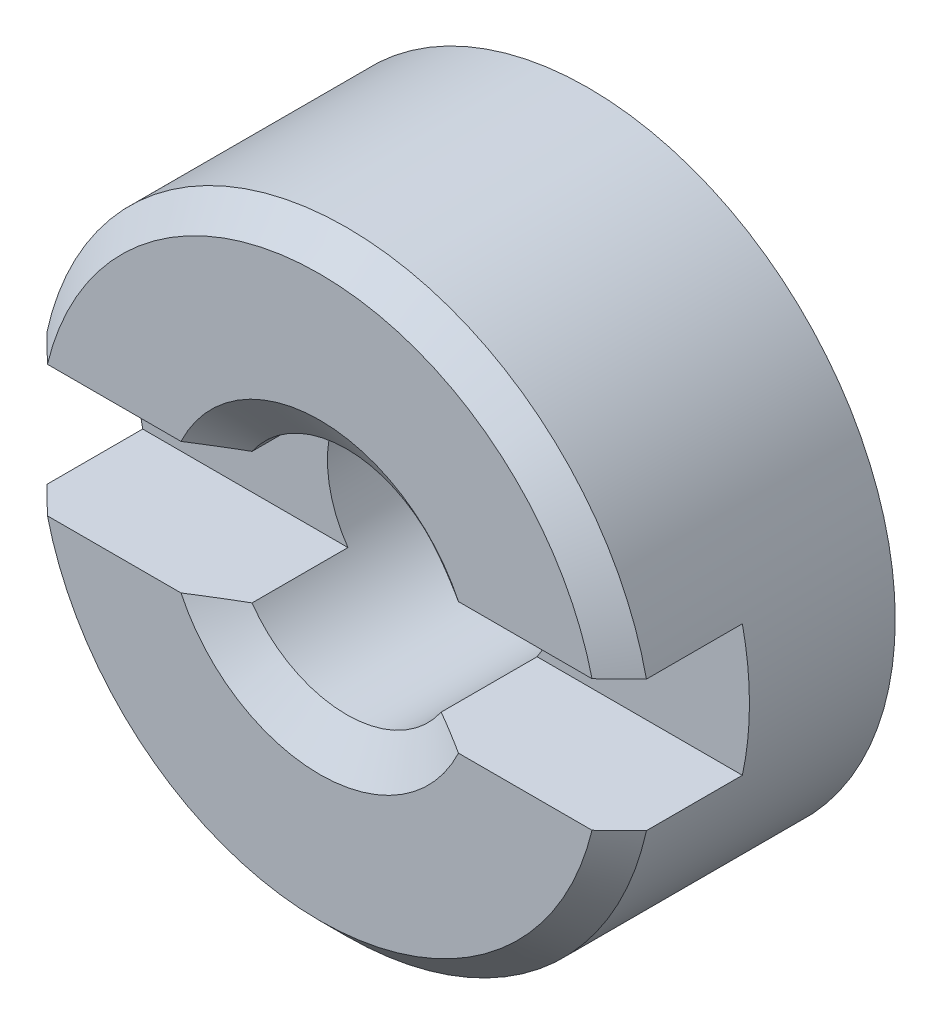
ISO-10303-21;
HEADER;
FILE_DESCRIPTION(('STEP AP214'),'2;1');
FILE_NAME('part.step','',(''),(''),'','','');
FILE_SCHEMA(('AUTOMOTIVE_DESIGN { 1 0 10303 214 1 1 1 1 }'));
ENDSEC;
DATA;
#1=APPLICATION_CONTEXT('core data for automotive mechanical design processes');
#2=APPLICATION_PROTOCOL_DEFINITION('international standard','automotive_design',2000,#1);
#3=PRODUCT_CONTEXT('',#1,'mechanical');
#4=PRODUCT('Part','Part','',(#3));
#5=PRODUCT_RELATED_PRODUCT_CATEGORY('part','',(#4));
#6=PRODUCT_DEFINITION_FORMATION('','',#4);
#7=PRODUCT_DEFINITION_CONTEXT('part definition',#1,'design');
#8=PRODUCT_DEFINITION('design','',#6,#7);
#9=PRODUCT_DEFINITION_SHAPE('','',#8);
#10=(LENGTH_UNIT() NAMED_UNIT(*) SI_UNIT(.MILLI.,.METRE.));
#11=(NAMED_UNIT(*) PLANE_ANGLE_UNIT() SI_UNIT($,.RADIAN.));
#12=(NAMED_UNIT(*) SI_UNIT($,.STERADIAN.) SOLID_ANGLE_UNIT());
#13=UNCERTAINTY_MEASURE_WITH_UNIT(LENGTH_MEASURE(1.E-05),#10,'distance_accuracy_value','');
#14=(GEOMETRIC_REPRESENTATION_CONTEXT(3) GLOBAL_UNCERTAINTY_ASSIGNED_CONTEXT((#13)) GLOBAL_UNIT_ASSIGNED_CONTEXT((#10,
#11,#12)) REPRESENTATION_CONTEXT('',''));
#15=CARTESIAN_POINT('',(0.,0.,0.));
#16=DIRECTION('',(0.,0.,1.));
#17=DIRECTION('',(1.,0.,0.));
#18=AXIS2_PLACEMENT_3D('',#15,#16,#17);
#19=CARTESIAN_POINT('',(0.,0.,0.));
#20=DIRECTION('',(0.,0.,1.));
#21=DIRECTION('',(1.,0.,0.));
#22=AXIS2_PLACEMENT_3D('',#19,#20,#21);
#23=PLANE('',#22);
#24=DIRECTION('',(1.,0.,0.));
#25=VECTOR('',#24,1.);
#26=CARTESIAN_POINT('',(-4.,-0.855000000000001,0.));
#27=LINE('',#26,#25);
#28=CARTESIAN_POINT('',(-3.54844684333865,-0.855000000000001,0.));
#29=VERTEX_POINT('',#28);
#30=CARTESIAN_POINT('',(-1.80803069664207,-0.855000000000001,0.));
#31=VERTEX_POINT('',#30);
#32=EDGE_CURVE('E298',#29,#31,#27,.T.);
#33=ORIENTED_EDGE('',*,*,#32,.F.);
#34=CARTESIAN_POINT('',(0.,0.,0.));
#35=DIRECTION('',(0.,0.,1.));
#36=DIRECTION('',(1.,0.,0.));
#37=AXIS2_PLACEMENT_3D('',#34,#35,#36);
#38=CIRCLE('',#37,3.65);
#39=CARTESIAN_POINT('',(3.54844684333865,-0.855000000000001,0.));
#40=VERTEX_POINT('',#39);
#41=EDGE_CURVE('E160',#29,#40,#38,.T.);
#42=ORIENTED_EDGE('',*,*,#41,.T.);
#43=CARTESIAN_POINT('',(1.80803069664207,-0.855000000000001,0.));
#44=VERTEX_POINT('',#43);
#45=EDGE_CURVE('E142',#44,#40,#27,.T.);
#46=ORIENTED_EDGE('',*,*,#45,.F.);
#47=CARTESIAN_POINT('',(0.,0.,0.));
#48=DIRECTION('',(0.,0.,1.));
#49=DIRECTION('',(1.,0.,0.));
#50=AXIS2_PLACEMENT_3D('',#47,#48,#49);
#51=CIRCLE('',#50,2.);
#52=EDGE_CURVE('E148',#31,#44,#51,.T.);
#53=ORIENTED_EDGE('',*,*,#52,.F.);
#54=EDGE_LOOP('',(#33,#42,#46,#53));
#55=FACE_BOUND('',#54,.T.);
#56=ADVANCED_FACE('F35',(#55),#23,.T.);
#57=CARTESIAN_POINT('',(0.,0.,-0.385114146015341));
#58=DIRECTION('',(0.,0.,1.));
#59=DIRECTION('',(1.,0.,0.));
#60=AXIS2_PLACEMENT_3D('',#57,#58,#59);
#61=CONICAL_SURFACE('',#60,1.45,0.959931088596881);
#62=CARTESIAN_POINT('',(-4.40937540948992,-0.855000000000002,1.74457053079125));
#63=CARTESIAN_POINT('',(-4.25360723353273,-0.855000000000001,1.63751142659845));
#64=CARTESIAN_POINT('',(-4.09775711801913,-0.855000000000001,1.53057062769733));
#65=CARTESIAN_POINT('',(-3.78577037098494,-0.855000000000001,1.31706999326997));
#66=CARTESIAN_POINT('',(-3.62963370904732,-0.855000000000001,1.21051020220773));
#67=CARTESIAN_POINT('',(-3.32079444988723,-0.855000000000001,1.00052931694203));
#68=CARTESIAN_POINT('',(-3.16810085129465,-0.855000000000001,0.897094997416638));
#69=CARTESIAN_POINT('',(-2.86219919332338,-0.855000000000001,0.691020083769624));
#70=CARTESIAN_POINT('',(-2.70899118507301,-0.855000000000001,0.58837941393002));
#71=CARTESIAN_POINT('',(-2.46315012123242,-0.855000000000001,0.425138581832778));
#72=CARTESIAN_POINT('',(-2.37078524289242,-0.855000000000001,0.364134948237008));
#73=CARTESIAN_POINT('',(-2.18564135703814,-0.855000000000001,0.242760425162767));
#74=CARTESIAN_POINT('',(-2.0928623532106,-0.855000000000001,0.182389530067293));
#75=CARTESIAN_POINT('',(-1.90509299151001,-0.855000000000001,0.061495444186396));
#76=CARTESIAN_POINT('',(-1.81009237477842,-0.855000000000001,0.000988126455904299));
#77=CARTESIAN_POINT('',(-1.61921586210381,-0.855000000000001,-0.1186201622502));
#78=CARTESIAN_POINT('',(-1.52334001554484,-0.855000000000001,-0.177721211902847));
#79=CARTESIAN_POINT('',(-1.32863387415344,-0.855000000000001,-0.294684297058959));
#80=CARTESIAN_POINT('',(-1.22978097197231,-0.855000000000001,-0.35250924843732));
#81=CARTESIAN_POINT('',(-1.0796375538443,-0.855000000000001,-0.436327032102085));
#82=CARTESIAN_POINT('',(-1.02919029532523,-0.855000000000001,-0.463824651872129));
#83=CARTESIAN_POINT('',(-0.927557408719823,-0.855000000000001,-0.517413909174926));
#84=CARTESIAN_POINT('',(-0.876371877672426,-0.855000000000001,-0.543505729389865));
#85=CARTESIAN_POINT('',(-0.774429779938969,-0.855000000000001,-0.59306129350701));
#86=CARTESIAN_POINT('',(-0.72369861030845,-0.855000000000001,-0.61657679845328));
#87=CARTESIAN_POINT('',(-0.621060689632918,-0.855000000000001,-0.661003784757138));
#88=CARTESIAN_POINT('',(-0.569153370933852,-0.855,-0.681913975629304));
#89=CARTESIAN_POINT('',(-0.464282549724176,-0.855,-0.719886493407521));
#90=CARTESIAN_POINT('',(-0.411327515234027,-0.855,-0.736971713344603));
#91=CARTESIAN_POINT('',(-0.304042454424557,-0.855,-0.765949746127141));
#92=CARTESIAN_POINT('',(-0.24971472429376,-0.855,-0.777850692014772));
#93=CARTESIAN_POINT('',(-0.155937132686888,-0.855,-0.792443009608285));
#94=CARTESIAN_POINT('',(-0.116749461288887,-0.855,-0.796805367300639));
#95=CARTESIAN_POINT('',(-0.0381121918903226,-0.855,-0.801769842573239));
#96=CARTESIAN_POINT('',(0.00133750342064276,-0.855,-0.802370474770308));
#97=CARTESIAN_POINT('',(0.0802103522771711,-0.855,-0.799744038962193));
#98=CARTESIAN_POINT('',(0.119633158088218,-0.855,-0.796506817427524));
#99=CARTESIAN_POINT('',(0.198016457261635,-0.855,-0.786485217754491));
#100=CARTESIAN_POINT('',(0.236976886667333,-0.855,-0.779700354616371));
#101=CARTESIAN_POINT('',(0.349917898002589,-0.855,-0.755440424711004));
#102=CARTESIAN_POINT('',(0.42301252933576,-0.855,-0.733879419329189));
#103=CARTESIAN_POINT('',(0.566671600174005,-0.855,-0.683518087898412));
#104=CARTESIAN_POINT('',(0.637230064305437,-0.855000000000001,-0.654701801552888));
#105=CARTESIAN_POINT('',(0.777924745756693,-0.855000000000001,-0.591925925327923));
#106=CARTESIAN_POINT('',(0.848014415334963,-0.855000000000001,-0.557863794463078));
#107=CARTESIAN_POINT('',(0.951970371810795,-0.855000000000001,-0.504607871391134));
#108=CARTESIAN_POINT('',(0.986408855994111,-0.855000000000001,-0.486505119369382));
#109=CARTESIAN_POINT('',(1.05496676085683,-0.855000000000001,-0.449705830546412));
#110=CARTESIAN_POINT('',(1.08908619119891,-0.855000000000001,-0.431009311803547));
#111=CARTESIAN_POINT('',(1.19991214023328,-0.855000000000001,-0.369269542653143));
#112=CARTESIAN_POINT('',(1.27607417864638,-0.855000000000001,-0.325251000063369));
#113=CARTESIAN_POINT('',(1.4274755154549,-0.855000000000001,-0.235650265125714));
#114=CARTESIAN_POINT('',(1.50271470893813,-0.855000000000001,-0.190067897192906));
#115=CARTESIAN_POINT('',(1.65255851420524,-0.855000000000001,-0.0978219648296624));
#116=CARTESIAN_POINT('',(1.72716291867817,-0.855000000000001,-0.0511580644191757));
#117=CARTESIAN_POINT('',(1.87589265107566,-0.855000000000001,0.0429281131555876));
#118=CARTESIAN_POINT('',(1.95001796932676,-0.855000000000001,0.0903504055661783));
#119=CARTESIAN_POINT('',(2.17208557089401,-0.855000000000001,0.233578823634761));
#120=CARTESIAN_POINT('',(2.31949672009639,-0.855000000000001,0.330207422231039));
#121=CARTESIAN_POINT('',(2.61345746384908,-0.855000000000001,0.524698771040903));
#122=CARTESIAN_POINT('',(2.76000721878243,-0.855000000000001,0.622561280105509));
#123=CARTESIAN_POINT('',(3.03223995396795,-0.855000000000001,0.805432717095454));
#124=CARTESIAN_POINT('',(3.15799261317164,-0.855000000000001,0.890337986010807));
#125=CARTESIAN_POINT('',(3.40922033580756,-0.855000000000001,1.06057383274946));
#126=CARTESIAN_POINT('',(3.53469538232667,-0.855000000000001,1.14590443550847));
#127=CARTESIAN_POINT('',(3.78513117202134,-0.855000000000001,1.31666361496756));
#128=CARTESIAN_POINT('',(3.9100924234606,-0.855000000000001,1.40209144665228));
#129=CARTESIAN_POINT('',(4.15984639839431,-0.855000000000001,1.57317575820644));
#130=CARTESIAN_POINT('',(4.28463913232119,-0.855000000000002,1.65883222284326));
#131=CARTESIAN_POINT('',(4.40937540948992,-0.855000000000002,1.74457053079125));
#132=B_SPLINE_CURVE_WITH_KNOTS('',3,(#62,#63,#64,#65,#66,#67,#68,#69,#70,#71,#72,#73,#74,#75,
#76,#77,#78,#79,#80,#81,#82,#83,#84,#85,#86,#87,#88,#89,#90,#91,#92,#93,#94,#95,#96,#97,#98,#99,
#100,#101,#102,#103,#104,#105,#106,#107,#108,#109,#110,#111,#112,#113,#114,#115,#116,#117,#118,
#119,#120,#121,#122,#123,#124,#125,#126,#127,#128,#129,#130,#131),.UNSPECIFIED.,.F.,.F.,(4,2,2,
2,2,2,2,2,2,2,2,2,2,2,2,2,2,2,2,2,2,2,2,2,2,2,2,2,2,2,2,2,2,2,4),(0.,0.567035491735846,
1.13413512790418,1.68742029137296,2.24065200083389,2.57272607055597,2.90479718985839,
3.24268795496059,3.58055977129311,3.92406456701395,4.09641350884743,4.26873999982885,
4.43643848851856,4.60421971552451,4.77096817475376,4.93745409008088,5.05558103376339,
5.17375461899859,5.29224154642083,5.41074467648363,5.63868407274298,5.86712934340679,
6.10079829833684,6.2175150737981,6.33422830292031,6.5980975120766,6.86199644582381,
7.12597848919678,7.38996584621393,7.91872833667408,8.44738904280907,8.90258413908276,
9.35780624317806,9.81191943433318,10.2660030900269),.UNSPECIFIED.);
#133=CARTESIAN_POINT('',(-1.23246703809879,-0.855000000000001,-0.350103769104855));
#134=VERTEX_POINT('',#133);
#135=EDGE_CURVE('E225',#31,#134,#132,.T.);
#136=ORIENTED_EDGE('',*,*,#135,.F.);
#137=ORIENTED_EDGE('',*,*,#52,.T.);
#138=CARTESIAN_POINT('',(1.23246703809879,-0.855000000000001,-0.350103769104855));
#139=VERTEX_POINT('',#138);
#140=EDGE_CURVE('E216',#139,#44,#132,.T.);
#141=ORIENTED_EDGE('',*,*,#140,.F.);
#142=CARTESIAN_POINT('',(0.,0.,-0.350103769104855));
#143=DIRECTION('',(0.,0.,1.));
#144=DIRECTION('',(1.,0.,0.));
#145=AXIS2_PLACEMENT_3D('',#142,#143,#144);
#146=CIRCLE('',#145,1.5);
#147=EDGE_CURVE('E150',#139,#134,#146,.F.);
#148=ORIENTED_EDGE('',*,*,#147,.T.);
#149=EDGE_LOOP('',(#136,#137,#141,#148));
#150=FACE_BOUND('',#149,.T.);
#151=ADVANCED_FACE('F210',(#150),#61,.F.);
#152=CARTESIAN_POINT('',(0.,0.,0.));
#153=DIRECTION('',(0.,0.,-1.));
#154=DIRECTION('',(-1.,0.,0.));
#155=AXIS2_PLACEMENT_3D('',#152,#153,#154);
#156=CONICAL_SURFACE('',#155,3.65,0.785398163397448);
#157=CARTESIAN_POINT('',(-8.76318031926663,-0.854999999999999,-5.15479155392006));
#158=CARTESIAN_POINT('',(-8.49402061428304,-0.854999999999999,-4.88691027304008));
#159=CARTESIAN_POINT('',(-8.22480880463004,-0.854999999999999,-4.61908130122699));
#160=CARTESIAN_POINT('',(-7.68620112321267,-0.854999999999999,-4.08355401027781));
#161=CARTESIAN_POINT('',(-7.41680523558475,-0.854999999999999,-3.81585570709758));
#162=CARTESIAN_POINT('',(-6.8770905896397,-0.854999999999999,-3.27996166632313));
#163=CARTESIAN_POINT('',(-6.60677127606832,-0.855,-3.01176648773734));
#164=CARTESIAN_POINT('',(-6.06585504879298,-0.855,-2.47571011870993));
#165=CARTESIAN_POINT('',(-5.79525816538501,-0.855,-2.20784889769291));
#166=CARTESIAN_POINT('',(-5.18301951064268,-0.855,-1.6028005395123));
#167=CARTESIAN_POINT('',(-4.84124731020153,-0.855,-1.26574518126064));
#168=CARTESIAN_POINT('',(-4.32755683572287,-0.855,-0.761097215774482));
#169=CARTESIAN_POINT('',(-4.15612571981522,-0.855000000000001,-0.593008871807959));
#170=CARTESIAN_POINT('',(-3.81279848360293,-0.855000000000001,-0.257319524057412));
#171=CARTESIAN_POINT('',(-3.64090238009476,-0.855000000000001,-0.0897185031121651));
#172=CARTESIAN_POINT('',(-3.29679451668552,-0.855000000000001,0.244388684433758));
#173=CARTESIAN_POINT('',(-3.12458432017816,-0.855000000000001,0.41089646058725));
#174=CARTESIAN_POINT('',(-2.77905025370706,-0.855000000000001,0.742803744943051));
#175=CARTESIAN_POINT('',(-2.60572623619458,-0.855000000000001,0.908203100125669));
#176=CARTESIAN_POINT('',(-2.34437209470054,-0.855000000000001,1.15474649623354));
#177=CARTESIAN_POINT('',(-2.25705293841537,-0.855000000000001,1.23664354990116));
#178=CARTESIAN_POINT('',(-2.08175909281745,-0.855000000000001,1.39973233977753));
#179=CARTESIAN_POINT('',(-1.99378441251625,-0.855000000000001,1.48092408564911));
#180=CARTESIAN_POINT('',(-1.81692974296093,-0.855000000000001,1.64227781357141));
#181=CARTESIAN_POINT('',(-1.72804995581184,-0.855000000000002,1.72244001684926));
#182=CARTESIAN_POINT('',(-1.54894207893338,-0.855000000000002,1.88124062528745));
#183=CARTESIAN_POINT('',(-1.4587141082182,-0.855000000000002,1.95987916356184));
#184=CARTESIAN_POINT('',(-1.3307530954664,-0.855000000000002,2.06836833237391));
#185=CARTESIAN_POINT('',(-1.29390585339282,-0.855000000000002,2.09926296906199));
#186=CARTESIAN_POINT('',(-1.21978899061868,-0.855000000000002,2.16054595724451));
#187=CARTESIAN_POINT('',(-1.18251935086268,-0.855000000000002,2.19093428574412));
#188=CARTESIAN_POINT('',(-1.10739658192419,-0.855000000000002,2.25112677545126));
#189=CARTESIAN_POINT('',(-1.06954250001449,-0.855000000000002,2.28092975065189));
#190=CARTESIAN_POINT('',(-0.993196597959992,-0.855000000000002,2.33970603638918));
#191=CARTESIAN_POINT('',(-0.954704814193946,-0.855000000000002,2.36867939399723));
#192=CARTESIAN_POINT('',(-0.8774934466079,-0.855000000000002,2.42511823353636));
#193=CARTESIAN_POINT('',(-0.83878555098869,-0.855000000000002,2.45259963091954));
#194=CARTESIAN_POINT('',(-0.760400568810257,-0.855000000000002,2.50614082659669));
#195=CARTESIAN_POINT('',(-0.720723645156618,-0.855000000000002,2.53220086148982));
#196=CARTESIAN_POINT('',(-0.640252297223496,-0.855000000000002,2.58231166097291));
#197=CARTESIAN_POINT('',(-0.59946100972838,-0.855000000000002,2.60636742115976));
#198=CARTESIAN_POINT('',(-0.516402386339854,-0.855000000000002,2.65175816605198));
#199=CARTESIAN_POINT('',(-0.474136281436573,-0.855000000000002,2.67309535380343));
#200=CARTESIAN_POINT('',(-0.403789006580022,-0.855000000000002,2.70475797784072));
#201=CARTESIAN_POINT('',(-0.376231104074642,-0.855000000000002,2.71624075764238));
#202=CARTESIAN_POINT('',(-0.32038714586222,-0.855000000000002,2.73730940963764));
#203=CARTESIAN_POINT('',(-0.292101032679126,-0.855000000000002,2.74689513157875));
#204=CARTESIAN_POINT('',(-0.235017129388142,-0.855000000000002,2.76370454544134));
#205=CARTESIAN_POINT('',(-0.20622363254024,-0.855000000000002,2.77094260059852));
#206=CARTESIAN_POINT('',(-0.148094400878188,-0.855000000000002,2.78273518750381));
#207=CARTESIAN_POINT('',(-0.118758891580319,-0.855000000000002,2.78729081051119));
#208=CARTESIAN_POINT('',(-0.0593417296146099,-0.855000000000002,2.79345944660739));
#209=CARTESIAN_POINT('',(-0.0292554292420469,-0.855000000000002,2.79502872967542));
#210=CARTESIAN_POINT('',(0.0309120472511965,-0.855000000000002,2.79497046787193));
#211=CARTESIAN_POINT('',(0.0609932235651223,-0.855000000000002,2.7933431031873));
#212=CARTESIAN_POINT('',(0.120937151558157,-0.855000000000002,2.78700616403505));
#213=CARTESIAN_POINT('',(0.150798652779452,-0.855000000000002,2.78228499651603));
#214=CARTESIAN_POINT('',(0.209955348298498,-0.855000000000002,2.77007561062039));
#215=CARTESIAN_POINT('',(0.239250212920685,-0.855000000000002,2.76258582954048));
#216=CARTESIAN_POINT('',(0.308220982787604,-0.855000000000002,2.7419442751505));
#217=CARTESIAN_POINT('',(0.347574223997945,-0.855000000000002,2.72772263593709));
#218=CARTESIAN_POINT('',(0.424880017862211,-0.855000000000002,2.69590172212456));
#219=CARTESIAN_POINT('',(0.462831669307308,-0.855000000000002,2.67830031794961));
#220=CARTESIAN_POINT('',(0.537636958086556,-0.855000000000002,2.64052895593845));
#221=CARTESIAN_POINT('',(0.574484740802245,-0.855000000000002,2.62034755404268));
#222=CARTESIAN_POINT('',(0.647081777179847,-0.855000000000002,2.57814709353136));
#223=CARTESIAN_POINT('',(0.682831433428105,-0.855000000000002,2.55612871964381));
#224=CARTESIAN_POINT('',(0.759786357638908,-0.855000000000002,2.50663594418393));
#225=CARTESIAN_POINT('',(0.800817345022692,-0.855000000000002,2.47889218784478));
#226=CARTESIAN_POINT('',(0.881906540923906,-0.855000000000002,2.42201221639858));
#227=CARTESIAN_POINT('',(0.921964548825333,-0.855000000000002,2.39287571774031));
#228=CARTESIAN_POINT('',(1.04104951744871,-0.855000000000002,2.30389540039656));
#229=CARTESIAN_POINT('',(1.11892845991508,-0.855000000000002,2.24252026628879));
#230=CARTESIAN_POINT('',(1.27292018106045,-0.855000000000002,2.11723483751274));
#231=CARTESIAN_POINT('',(1.34902791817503,-0.855000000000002,2.0533184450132));
#232=CARTESIAN_POINT('',(1.49988541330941,-0.855000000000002,1.92397073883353));
#233=CARTESIAN_POINT('',(1.57463573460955,-0.855000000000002,1.85854008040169));
#234=CARTESIAN_POINT('',(1.72354199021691,-0.855000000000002,1.72634534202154));
#235=CARTESIAN_POINT('',(1.79769377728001,-0.855000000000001,1.65957661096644));
#236=CARTESIAN_POINT('',(1.94532913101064,-0.855000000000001,1.5252902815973));
#237=CARTESIAN_POINT('',(2.01881262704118,-0.855000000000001,1.45777260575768));
#238=CARTESIAN_POINT('',(2.16515653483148,-0.855000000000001,1.32230505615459));
#239=CARTESIAN_POINT('',(2.2380177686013,-0.855000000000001,1.25435606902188));
#240=CARTESIAN_POINT('',(2.3833533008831,-0.855000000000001,1.11805115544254));
#241=CARTESIAN_POINT('',(2.4558276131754,-0.855000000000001,1.04969524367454));
#242=CARTESIAN_POINT('',(2.6625154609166,-0.855000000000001,0.853905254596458));
#243=CARTESIAN_POINT('',(2.79636531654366,-0.855000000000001,0.726087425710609));
#244=CARTESIAN_POINT('',(3.06338963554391,-0.855000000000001,0.469747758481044));
#245=CARTESIAN_POINT('',(3.19656409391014,-0.855000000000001,0.341225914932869));
#246=CARTESIAN_POINT('',(3.59540215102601,-0.855000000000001,-0.0450636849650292));
#247=CARTESIAN_POINT('',(3.86037191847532,-0.855000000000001,-0.303547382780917));
#248=CARTESIAN_POINT('',(4.38953969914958,-0.855,-0.821720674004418));
#249=CARTESIAN_POINT('',(4.65373693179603,-0.855,-1.0814110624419));
#250=CARTESIAN_POINT('',(5.18152543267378,-0.855,-1.6013984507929));
#251=CARTESIAN_POINT('',(5.44511671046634,-0.855,-1.86169544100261));
#252=CARTESIAN_POINT('',(5.96366512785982,-0.855,-2.37452580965));
#253=CARTESIAN_POINT('',(6.21863421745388,-0.855,-2.62704711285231));
#254=CARTESIAN_POINT('',(6.7283209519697,-0.854999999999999,-3.13234598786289));
#255=CARTESIAN_POINT('',(6.98303859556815,-0.854999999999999,-3.38512356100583));
#256=CARTESIAN_POINT('',(7.49207066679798,-0.854999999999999,-3.89064016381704));
#257=CARTESIAN_POINT('',(7.74638525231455,-0.854999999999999,-4.14337903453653));
#258=CARTESIAN_POINT('',(8.25487565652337,-0.854999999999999,-4.64899340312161));
#259=CARTESIAN_POINT('',(8.5090514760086,-0.854999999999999,-4.90186890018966));
#260=CARTESIAN_POINT('',(8.76318031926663,-0.854999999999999,-5.15479155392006));
#261=B_SPLINE_CURVE_WITH_KNOTS('',3,(#157,#158,#159,#160,#161,#162,#163,#164,#165,#166,#167,
#168,#169,#170,#171,#172,#173,#174,#175,#176,#177,#178,#179,#180,#181,#182,#183,#184,#185,#186,
#187,#188,#189,#190,#191,#192,#193,#194,#195,#196,#197,#198,#199,#200,#201,#202,#203,#204,#205,
#206,#207,#208,#209,#210,#211,#212,#213,#214,#215,#216,#217,#218,#219,#220,#221,#222,#223,#224,
#225,#226,#227,#228,#229,#230,#231,#232,#233,#234,#235,#236,#237,#238,#239,#240,#241,#242,#243,
#244,#245,#246,#247,#248,#249,#250,#251,#252,#253,#254,#255,#256,#257,#258,#259,#260),
.UNSPECIFIED.,.F.,.F.,(4,2,2,2,2,2,2,2,2,2,2,2,2,2,2,2,2,2,2,2,2,2,2,2,2,2,2,2,2,2,2,2,2,2,2,2,
2,2,2,2,2,2,2,2,2,2,2,2,2,2,2,4),(0.,1.13923923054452,2.27859369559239,3.42096410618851,
4.56322085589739,6.00326384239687,6.7235277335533,7.4437659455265,8.16239492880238,
8.88112115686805,9.2402646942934,9.59940330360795,9.95846340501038,10.3174919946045,
10.4617445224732,10.6060035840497,10.7505297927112,10.8950477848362,11.0374390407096,
11.1798065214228,11.3218078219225,11.463693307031,11.5532020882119,11.6427179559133,
11.7316753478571,11.8205965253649,11.9108100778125,12.0010185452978,12.0915669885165,
12.1821666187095,12.3074761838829,12.4328649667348,12.558830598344,12.6847494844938,
12.8332997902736,12.981880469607,13.2792544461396,13.5773910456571,13.8754009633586,
14.1747422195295,14.4741147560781,14.772998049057,15.0718706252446,15.6270944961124,
16.1823224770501,17.2928137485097,18.4041874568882,19.5155435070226,20.592105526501,
21.6686731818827,22.7443011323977,23.8199228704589),.UNSPECIFIED.);
#262=CARTESIAN_POINT('',(-3.90755358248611,-0.855000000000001,-0.350000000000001));
#263=VERTEX_POINT('',#262);
#264=EDGE_CURVE('E305',#263,#29,#261,.T.);
#265=ORIENTED_EDGE('',*,*,#264,.F.);
#266=CARTESIAN_POINT('',(0.,0.,-0.350000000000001));
#267=DIRECTION('',(0.,0.,1.));
#268=DIRECTION('',(1.,0.,0.));
#269=AXIS2_PLACEMENT_3D('',#266,#267,#268);
#270=CIRCLE('',#269,4.);
#271=CARTESIAN_POINT('',(3.90755358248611,-0.855000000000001,-0.350000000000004));
#272=VERTEX_POINT('',#271);
#273=EDGE_CURVE('E172',#272,#263,#270,.F.);
#274=ORIENTED_EDGE('',*,*,#273,.F.);
#275=EDGE_CURVE('E180',#40,#272,#261,.T.);
#276=ORIENTED_EDGE('',*,*,#275,.F.);
#277=ORIENTED_EDGE('',*,*,#41,.F.);
#278=EDGE_LOOP('',(#265,#274,#276,#277));
#279=FACE_BOUND('',#278,.T.);
#280=ADVANCED_FACE('F248',(#279),#156,.T.);
#281=CARTESIAN_POINT('',(0.,0.,-3.5));
#282=DIRECTION('',(0.,0.,1.));
#283=DIRECTION('',(1.,0.,0.));
#284=AXIS2_PLACEMENT_3D('',#281,#282,#283);
#285=CYLINDRICAL_SURFACE('',#284,1.5);
#286=CARTESIAN_POINT('',(0.,0.,-1.6));
#287=DIRECTION('',(0.,0.,-1.));
#288=DIRECTION('',(-1.,0.,0.));
#289=AXIS2_PLACEMENT_3D('',#286,#287,#288);
#290=CIRCLE('',#289,1.5);
#291=CARTESIAN_POINT('',(-1.23246703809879,0.855,-1.6));
#292=VERTEX_POINT('',#291);
#293=CARTESIAN_POINT('',(-1.23246703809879,-0.855,-1.6));
#294=VERTEX_POINT('',#293);
#295=EDGE_CURVE('E231',#292,#294,#290,.F.);
#296=ORIENTED_EDGE('',*,*,#295,.T.);
#297=DIRECTION('',(0.,0.,1.));
#298=VECTOR('',#297,1.);
#299=CARTESIAN_POINT('',(-1.23246703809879,-0.854999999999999,-3.5));
#300=LINE('',#299,#298);
#301=EDGE_CURVE('E229',#294,#134,#300,.T.);
#302=ORIENTED_EDGE('',*,*,#301,.T.);
#303=ORIENTED_EDGE('',*,*,#147,.F.);
#304=DIRECTION('',(0.,0.,1.));
#305=VECTOR('',#304,1.);
#306=CARTESIAN_POINT('',(1.23246703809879,-0.854999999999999,-3.5));
#307=LINE('',#306,#305);
#308=CARTESIAN_POINT('',(1.23246703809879,-0.855,-1.6));
#309=VERTEX_POINT('',#308);
#310=EDGE_CURVE('E223',#139,#309,#307,.F.);
#311=ORIENTED_EDGE('',*,*,#310,.T.);
#312=CARTESIAN_POINT('',(1.23246703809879,0.855,-1.6));
#313=VERTEX_POINT('',#312);
#314=EDGE_CURVE('E233',#309,#313,#290,.F.);
#315=ORIENTED_EDGE('',*,*,#314,.T.);
#316=DIRECTION('',(0.,0.,1.));
#317=VECTOR('',#316,1.);
#318=CARTESIAN_POINT('',(1.23246703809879,0.855,-3.5));
#319=LINE('',#318,#317);
#320=CARTESIAN_POINT('',(1.23246703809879,0.855,-0.350103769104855));
#321=VERTEX_POINT('',#320);
#322=EDGE_CURVE('E319',#313,#321,#319,.T.);
#323=ORIENTED_EDGE('',*,*,#322,.T.);
#324=CARTESIAN_POINT('',(-1.23246703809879,0.855,-0.350103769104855));
#325=VERTEX_POINT('',#324);
#326=EDGE_CURVE('E147',#325,#321,#146,.F.);
#327=ORIENTED_EDGE('',*,*,#326,.F.);
#328=DIRECTION('',(0.,0.,1.));
#329=VECTOR('',#328,1.);
#330=CARTESIAN_POINT('',(-1.23246703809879,0.855,-3.5));
#331=LINE('',#330,#329);
#332=EDGE_CURVE('E127',#325,#292,#331,.F.);
#333=ORIENTED_EDGE('',*,*,#332,.T.);
#334=EDGE_LOOP('',(#296,#302,#303,#311,#315,#323,#327,#333));
#335=FACE_BOUND('',#334,.T.);
#336=CARTESIAN_POINT('',(0.,0.,-3.12449623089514));
#337=DIRECTION('',(0.,0.,-1.));
#338=DIRECTION('',(-1.,0.,0.));
#339=AXIS2_PLACEMENT_3D('',#336,#337,#338);
#340=CIRCLE('',#339,1.5);
#341=CARTESIAN_POINT('',(-1.5,0.,-3.12449623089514));
#342=VERTEX_POINT('',#341);
#343=EDGE_CURVE('E153',#342,#342,#340,.F.);
#344=ORIENTED_EDGE('',*,*,#343,.F.);
#345=EDGE_LOOP('',(#344));
#346=FACE_BOUND('',#345,.T.);
#347=ADVANCED_FACE('F212',(#335,#346),#285,.F.);
#348=CARTESIAN_POINT('',(0.,0.,-3.5));
#349=DIRECTION('',(0.,0.,1.));
#350=DIRECTION('',(1.,0.,0.));
#351=AXIS2_PLACEMENT_3D('',#348,#349,#350);
#352=CYLINDRICAL_SURFACE('',#351,4.);
#353=CARTESIAN_POINT('',(0.,0.,-1.6));
#354=DIRECTION('',(0.,0.,-1.));
#355=DIRECTION('',(-1.,0.,0.));
#356=AXIS2_PLACEMENT_3D('',#353,#354,#355);
#357=CIRCLE('',#356,4.);
#358=CARTESIAN_POINT('',(3.90755358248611,-0.855,-1.6));
#359=VERTEX_POINT('',#358);
#360=CARTESIAN_POINT('',(3.90755358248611,0.855,-1.6));
#361=VERTEX_POINT('',#360);
#362=EDGE_CURVE('E40',#359,#361,#357,.F.);
#363=ORIENTED_EDGE('',*,*,#362,.F.);
#364=DIRECTION('',(0.,0.,1.));
#365=VECTOR('',#364,1.);
#366=CARTESIAN_POINT('',(3.90755358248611,-0.854999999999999,-3.5));
#367=LINE('',#366,#365);
#368=EDGE_CURVE('E320',#272,#359,#367,.F.);
#369=ORIENTED_EDGE('',*,*,#368,.F.);
#370=ORIENTED_EDGE('',*,*,#273,.T.);
#371=DIRECTION('',(0.,0.,1.));
#372=VECTOR('',#371,1.);
#373=CARTESIAN_POINT('',(-3.90755358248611,-0.854999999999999,-3.5));
#374=LINE('',#373,#372);
#375=CARTESIAN_POINT('',(-3.90755358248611,-0.855,-1.6));
#376=VERTEX_POINT('',#375);
#377=EDGE_CURVE('E224',#376,#263,#374,.T.);
#378=ORIENTED_EDGE('',*,*,#377,.F.);
#379=CARTESIAN_POINT('',(-3.90755358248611,0.855,-1.6));
#380=VERTEX_POINT('',#379);
#381=EDGE_CURVE('E11',#380,#376,#357,.F.);
#382=ORIENTED_EDGE('',*,*,#381,.F.);
#383=DIRECTION('',(0.,0.,1.));
#384=VECTOR('',#383,1.);
#385=CARTESIAN_POINT('',(-3.90755358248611,0.855,-3.5));
#386=LINE('',#385,#384);
#387=CARTESIAN_POINT('',(-3.90755358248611,0.855,-0.350000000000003));
#388=VERTEX_POINT('',#387);
#389=EDGE_CURVE('E287',#388,#380,#386,.F.);
#390=ORIENTED_EDGE('',*,*,#389,.F.);
#391=CARTESIAN_POINT('',(3.90755358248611,0.855,-0.350000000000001));
#392=VERTEX_POINT('',#391);
#393=EDGE_CURVE('E169',#388,#392,#270,.F.);
#394=ORIENTED_EDGE('',*,*,#393,.T.);
#395=DIRECTION('',(0.,0.,1.));
#396=VECTOR('',#395,1.);
#397=CARTESIAN_POINT('',(3.90755358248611,0.855,-3.5));
#398=LINE('',#397,#396);
#399=EDGE_CURVE('E59',#361,#392,#398,.T.);
#400=ORIENTED_EDGE('',*,*,#399,.F.);
#401=EDGE_LOOP('',(#363,#369,#370,#378,#382,#390,#394,#400));
#402=FACE_BOUND('',#401,.T.);
#403=CARTESIAN_POINT('',(0.,0.,-3.5));
#404=DIRECTION('',(0.,0.,1.));
#405=DIRECTION('',(1.,0.,0.));
#406=AXIS2_PLACEMENT_3D('',#403,#404,#405);
#407=CIRCLE('',#406,4.);
#408=CARTESIAN_POINT('',(4.,0.,-3.5));
#409=VERTEX_POINT('',#408);
#410=EDGE_CURVE('E158',#409,#409,#407,.T.);
#411=ORIENTED_EDGE('',*,*,#410,.T.);
#412=EDGE_LOOP('',(#411));
#413=FACE_BOUND('',#412,.T.);
#414=ADVANCED_FACE('F247',(#402,#413),#352,.T.);
#415=CARTESIAN_POINT('',(0.,0.,-3.5));
#416=DIRECTION('',(0.,0.,1.));
#417=DIRECTION('',(1.,0.,0.));
#418=AXIS2_PLACEMENT_3D('',#415,#416,#417);
#419=PLANE('',#418);
#420=CARTESIAN_POINT('',(0.,0.,-3.5));
#421=DIRECTION('',(0.,0.,1.));
#422=DIRECTION('',(1.,0.,0.));
#423=AXIS2_PLACEMENT_3D('',#420,#421,#422);
#424=CIRCLE('',#423,2.);
#425=CARTESIAN_POINT('',(2.,0.,-3.5));
#426=VERTEX_POINT('',#425);
#427=EDGE_CURVE('E163',#426,#426,#424,.F.);
#428=ORIENTED_EDGE('',*,*,#427,.F.);
#429=EDGE_LOOP('',(#428));
#430=FACE_BOUND('',#429,.T.);
#431=ORIENTED_EDGE('',*,*,#410,.F.);
#432=EDGE_LOOP('',(#431));
#433=FACE_BOUND('',#432,.T.);
#434=ADVANCED_FACE('F253',(#430,#433),#419,.F.);
#435=DIRECTION('',(1.,0.,0.));
#436=VECTOR('',#435,1.);
#437=CARTESIAN_POINT('',(-4.,0.855,0.));
#438=LINE('',#437,#436);
#439=CARTESIAN_POINT('',(1.80803069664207,0.855,0.));
#440=VERTEX_POINT('',#439);
#441=CARTESIAN_POINT('',(3.54844684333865,0.855,0.));
#442=VERTEX_POINT('',#441);
#443=EDGE_CURVE('E143',#440,#442,#438,.T.);
#444=ORIENTED_EDGE('',*,*,#443,.T.);
#445=CARTESIAN_POINT('',(-3.54844684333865,0.855,0.));
#446=VERTEX_POINT('',#445);
#447=EDGE_CURVE('E141',#442,#446,#38,.T.);
#448=ORIENTED_EDGE('',*,*,#447,.T.);
#449=CARTESIAN_POINT('',(-1.80803069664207,0.855,0.));
#450=VERTEX_POINT('',#449);
#451=EDGE_CURVE('E51',#446,#450,#438,.T.);
#452=ORIENTED_EDGE('',*,*,#451,.T.);
#453=EDGE_CURVE('E139',#440,#450,#51,.T.);
#454=ORIENTED_EDGE('',*,*,#453,.F.);
#455=EDGE_LOOP('',(#444,#448,#452,#454));
#456=FACE_BOUND('',#455,.T.);
#457=ADVANCED_FACE('F138',(#456),#23,.T.);
#458=CARTESIAN_POINT('',(4.40937540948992,0.855,1.74457053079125));
#459=CARTESIAN_POINT('',(4.25360723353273,0.855,1.63751142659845));
#460=CARTESIAN_POINT('',(4.09775711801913,0.855,1.53057062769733));
#461=CARTESIAN_POINT('',(3.78577037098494,0.855,1.31706999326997));
#462=CARTESIAN_POINT('',(3.62963370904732,0.855,1.21051020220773));
#463=CARTESIAN_POINT('',(3.32079444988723,0.855,1.00052931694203));
#464=CARTESIAN_POINT('',(3.16810085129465,0.855,0.897094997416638));
#465=CARTESIAN_POINT('',(2.86219919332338,0.855,0.691020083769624));
#466=CARTESIAN_POINT('',(2.70899118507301,0.855,0.58837941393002));
#467=CARTESIAN_POINT('',(2.46315012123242,0.855,0.425138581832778));
#468=CARTESIAN_POINT('',(2.37078524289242,0.855,0.364134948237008));
#469=CARTESIAN_POINT('',(2.18564135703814,0.855,0.242760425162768));
#470=CARTESIAN_POINT('',(2.0928623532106,0.855,0.182389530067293));
#471=CARTESIAN_POINT('',(1.90509299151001,0.855,0.0614954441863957));
#472=CARTESIAN_POINT('',(1.81009237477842,0.855,0.000988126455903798));
#473=CARTESIAN_POINT('',(1.61921586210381,0.855,-0.118620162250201));
#474=CARTESIAN_POINT('',(1.52334001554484,0.855,-0.177721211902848));
#475=CARTESIAN_POINT('',(1.32863387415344,0.855,-0.294684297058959));
#476=CARTESIAN_POINT('',(1.22978097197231,0.855,-0.35250924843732));
#477=CARTESIAN_POINT('',(1.0796375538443,0.855,-0.436327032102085));
#478=CARTESIAN_POINT('',(1.02919029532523,0.855,-0.463824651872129));
#479=CARTESIAN_POINT('',(0.927557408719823,0.855,-0.517413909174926));
#480=CARTESIAN_POINT('',(0.876371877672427,0.855,-0.543505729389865));
#481=CARTESIAN_POINT('',(0.77442977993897,0.855,-0.59306129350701));
#482=CARTESIAN_POINT('',(0.723698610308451,0.855,-0.61657679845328));
#483=CARTESIAN_POINT('',(0.62106068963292,0.855,-0.661003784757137));
#484=CARTESIAN_POINT('',(0.569153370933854,0.855,-0.681913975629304));
#485=CARTESIAN_POINT('',(0.464282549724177,0.855,-0.719886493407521));
#486=CARTESIAN_POINT('',(0.411327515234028,0.855,-0.736971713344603));
#487=CARTESIAN_POINT('',(0.304042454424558,0.855,-0.765949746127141));
#488=CARTESIAN_POINT('',(0.249714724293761,0.855,-0.777850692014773));
#489=CARTESIAN_POINT('',(0.155937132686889,0.855,-0.792443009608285));
#490=CARTESIAN_POINT('',(0.116749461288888,0.855,-0.796805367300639));
#491=CARTESIAN_POINT('',(0.0381121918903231,0.855,-0.801769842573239));
#492=CARTESIAN_POINT('',(-0.00133750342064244,0.855,-0.802370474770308));
#493=CARTESIAN_POINT('',(-0.0802103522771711,0.855,-0.799744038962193));
#494=CARTESIAN_POINT('',(-0.119633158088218,0.855,-0.796506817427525));
#495=CARTESIAN_POINT('',(-0.198016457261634,0.855,-0.786485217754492));
#496=CARTESIAN_POINT('',(-0.236976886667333,0.855,-0.779700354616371));
#497=CARTESIAN_POINT('',(-0.349917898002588,0.855,-0.755440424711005));
#498=CARTESIAN_POINT('',(-0.423012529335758,0.855,-0.73387941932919));
#499=CARTESIAN_POINT('',(-0.566671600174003,0.855,-0.683518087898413));
#500=CARTESIAN_POINT('',(-0.637230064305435,0.855,-0.654701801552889));
#501=CARTESIAN_POINT('',(-0.777924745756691,0.855,-0.591925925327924));
#502=CARTESIAN_POINT('',(-0.848014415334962,0.855,-0.557863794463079));
#503=CARTESIAN_POINT('',(-0.951970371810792,0.855,-0.504607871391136));
#504=CARTESIAN_POINT('',(-0.986408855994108,0.855,-0.486505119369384));
#505=CARTESIAN_POINT('',(-1.05496676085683,0.855,-0.449705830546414));
#506=CARTESIAN_POINT('',(-1.0890861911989,0.855,-0.431009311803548));
#507=CARTESIAN_POINT('',(-1.19991214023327,0.855,-0.369269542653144));
#508=CARTESIAN_POINT('',(-1.27607417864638,0.855,-0.325251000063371));
#509=CARTESIAN_POINT('',(-1.4274755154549,0.855,-0.235650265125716));
#510=CARTESIAN_POINT('',(-1.50271470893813,0.855,-0.190067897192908));
#511=CARTESIAN_POINT('',(-1.65255851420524,0.855,-0.0978219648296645));
#512=CARTESIAN_POINT('',(-1.72716291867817,0.855,-0.0511580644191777));
#513=CARTESIAN_POINT('',(-1.87589265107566,0.855,0.0429281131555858));
#514=CARTESIAN_POINT('',(-1.95001796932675,0.855,0.0903504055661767));
#515=CARTESIAN_POINT('',(-2.17208557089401,0.855,0.23357882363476));
#516=CARTESIAN_POINT('',(-2.31949672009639,0.855,0.330207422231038));
#517=CARTESIAN_POINT('',(-2.61345746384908,0.855,0.524698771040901));
#518=CARTESIAN_POINT('',(-2.76000721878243,0.855,0.622561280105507));
#519=CARTESIAN_POINT('',(-3.03223995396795,0.855,0.805432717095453));
#520=CARTESIAN_POINT('',(-3.15799261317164,0.855,0.890337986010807));
#521=CARTESIAN_POINT('',(-3.40922033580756,0.855,1.06057383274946));
#522=CARTESIAN_POINT('',(-3.53469538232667,0.855,1.14590443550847));
#523=CARTESIAN_POINT('',(-3.78513117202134,0.855,1.31666361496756));
#524=CARTESIAN_POINT('',(-3.9100924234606,0.855,1.40209144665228));
#525=CARTESIAN_POINT('',(-4.15984639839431,0.855,1.57317575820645));
#526=CARTESIAN_POINT('',(-4.28463913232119,0.855,1.65883222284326));
#527=CARTESIAN_POINT('',(-4.40937540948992,0.855,1.74457053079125));
#528=B_SPLINE_CURVE_WITH_KNOTS('',3,(#458,#459,#460,#461,#462,#463,#464,#465,#466,#467,#468,
#469,#470,#471,#472,#473,#474,#475,#476,#477,#478,#479,#480,#481,#482,#483,#484,#485,#486,#487,
#488,#489,#490,#491,#492,#493,#494,#495,#496,#497,#498,#499,#500,#501,#502,#503,#504,#505,#506,
#507,#508,#509,#510,#511,#512,#513,#514,#515,#516,#517,#518,#519,#520,#521,#522,#523,#524,#525,
#526,#527),.UNSPECIFIED.,.F.,.F.,(4,2,2,2,2,2,2,2,2,2,2,2,2,2,2,2,2,2,2,2,2,2,2,2,2,2,2,2,2,2,2,
2,2,2,4),(0.,0.567035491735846,1.13413512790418,1.68742029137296,2.24065200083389,
2.57272607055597,2.90479718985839,3.24268795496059,3.58055977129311,3.92406456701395,
4.09641350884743,4.26873999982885,4.43643848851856,4.60421971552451,4.77096817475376,
4.93745409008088,5.05558103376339,5.17375461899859,5.29224154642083,5.41074467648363,
5.63868407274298,5.86712934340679,6.10079829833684,6.21751507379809,6.33422830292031,
6.5980975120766,6.86199644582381,7.12597848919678,7.38996584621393,7.91872833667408,
8.44738904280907,8.90258413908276,9.35780624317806,9.81191943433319,10.2660030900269),.UNSPECIFIED.);
#529=EDGE_CURVE('E133',#440,#321,#528,.T.);
#530=ORIENTED_EDGE('',*,*,#529,.F.);
#531=ORIENTED_EDGE('',*,*,#453,.T.);
#532=EDGE_CURVE('E123',#325,#450,#528,.T.);
#533=ORIENTED_EDGE('',*,*,#532,.F.);
#534=ORIENTED_EDGE('',*,*,#326,.T.);
#535=EDGE_LOOP('',(#530,#531,#533,#534));
#536=FACE_BOUND('',#535,.T.);
#537=ADVANCED_FACE('F146',(#536),#61,.F.);
#538=CARTESIAN_POINT('',(0.,0.,-3.4746));
#539=DIRECTION('',(0.,0.,-1.));
#540=DIRECTION('',(-1.,0.,0.));
#541=AXIS2_PLACEMENT_3D('',#538,#539,#540);
#542=CONICAL_SURFACE('',#541,2.,0.95993108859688);
#543=CARTESIAN_POINT('',(0.,0.,-3.4746));
#544=DIRECTION('',(0.,0.,1.));
#545=DIRECTION('',(1.,0.,0.));
#546=AXIS2_PLACEMENT_3D('',#543,#544,#545);
#547=CIRCLE('',#546,2.);
#548=CARTESIAN_POINT('',(2.,0.,-3.4746));
#549=VERTEX_POINT('',#548);
#550=EDGE_CURVE('E156',#549,#549,#547,.T.);
#551=ORIENTED_EDGE('',*,*,#550,.F.);
#552=EDGE_LOOP('',(#551));
#553=FACE_BOUND('',#552,.T.);
#554=ORIENTED_EDGE('',*,*,#343,.T.);
#555=EDGE_LOOP('',(#554));
#556=FACE_BOUND('',#555,.T.);
#557=ADVANCED_FACE('F209',(#553,#556),#542,.F.);
#558=CARTESIAN_POINT('',(0.,0.,-25.0375057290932));
#559=DIRECTION('',(0.,0.,1.));
#560=DIRECTION('',(1.,0.,0.));
#561=AXIS2_PLACEMENT_3D('',#558,#559,#560);
#562=CYLINDRICAL_SURFACE('',#561,2.);
#563=ORIENTED_EDGE('',*,*,#550,.T.);
#564=EDGE_LOOP('',(#563));
#565=FACE_BOUND('',#564,.T.);
#566=ORIENTED_EDGE('',*,*,#427,.T.);
#567=EDGE_LOOP('',(#566));
#568=FACE_BOUND('',#567,.T.);
#569=ADVANCED_FACE('F211',(#565,#568),#562,.F.);
#570=CARTESIAN_POINT('',(8.76318031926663,0.855,-5.15479155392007));
#571=CARTESIAN_POINT('',(8.49402061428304,0.855,-4.88691027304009));
#572=CARTESIAN_POINT('',(8.22480880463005,0.855,-4.61908130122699));
#573=CARTESIAN_POINT('',(7.68620112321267,0.855,-4.08355401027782));
#574=CARTESIAN_POINT('',(7.41680523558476,0.855,-3.81585570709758));
#575=CARTESIAN_POINT('',(6.87709058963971,0.855,-3.27996166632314));
#576=CARTESIAN_POINT('',(6.60677127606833,0.855,-3.01176648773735));
#577=CARTESIAN_POINT('',(6.06585504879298,0.855,-2.47571011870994));
#578=CARTESIAN_POINT('',(5.79525816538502,0.855,-2.20784889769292));
#579=CARTESIAN_POINT('',(5.18301951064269,0.855,-1.60280053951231));
#580=CARTESIAN_POINT('',(4.84124731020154,0.855,-1.26574518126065));
#581=CARTESIAN_POINT('',(4.32755683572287,0.855,-0.761097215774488));
#582=CARTESIAN_POINT('',(4.15612571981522,0.855,-0.593008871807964));
#583=CARTESIAN_POINT('',(3.81279848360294,0.855,-0.257319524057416));
#584=CARTESIAN_POINT('',(3.64090238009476,0.855,-0.0897185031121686));
#585=CARTESIAN_POINT('',(3.29679451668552,0.855,0.244388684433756));
#586=CARTESIAN_POINT('',(3.12458432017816,0.855,0.410896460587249));
#587=CARTESIAN_POINT('',(2.77905025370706,0.855,0.742803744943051));
#588=CARTESIAN_POINT('',(2.60572623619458,0.855,0.908203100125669));
#589=CARTESIAN_POINT('',(2.34437209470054,0.855,1.15474649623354));
#590=CARTESIAN_POINT('',(2.25705293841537,0.855,1.23664354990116));
#591=CARTESIAN_POINT('',(2.08175909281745,0.855,1.39973233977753));
#592=CARTESIAN_POINT('',(1.99378441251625,0.855,1.48092408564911));
#593=CARTESIAN_POINT('',(1.81692974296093,0.855,1.64227781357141));
#594=CARTESIAN_POINT('',(1.72804995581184,0.855,1.72244001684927));
#595=CARTESIAN_POINT('',(1.54894207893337,0.855,1.88124062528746));
#596=CARTESIAN_POINT('',(1.4587141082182,0.855,1.95987916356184));
#597=CARTESIAN_POINT('',(1.33075309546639,0.855,2.06836833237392));
#598=CARTESIAN_POINT('',(1.29390585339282,0.855,2.099262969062));
#599=CARTESIAN_POINT('',(1.21978899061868,0.855,2.16054595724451));
#600=CARTESIAN_POINT('',(1.18251935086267,0.855,2.19093428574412));
#601=CARTESIAN_POINT('',(1.10739658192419,0.855,2.25112677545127));
#602=CARTESIAN_POINT('',(1.06954250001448,0.855,2.28092975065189));
#603=CARTESIAN_POINT('',(0.993196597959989,0.855,2.33970603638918));
#604=CARTESIAN_POINT('',(0.954704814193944,0.855,2.36867939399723));
#605=CARTESIAN_POINT('',(0.877493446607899,0.855,2.42511823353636));
#606=CARTESIAN_POINT('',(0.838785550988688,0.855,2.45259963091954));
#607=CARTESIAN_POINT('',(0.760400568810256,0.855,2.50614082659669));
#608=CARTESIAN_POINT('',(0.720723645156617,0.855,2.53220086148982));
#609=CARTESIAN_POINT('',(0.640252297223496,0.855,2.58231166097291));
#610=CARTESIAN_POINT('',(0.599461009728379,0.855,2.60636742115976));
#611=CARTESIAN_POINT('',(0.516402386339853,0.855,2.65175816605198));
#612=CARTESIAN_POINT('',(0.474136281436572,0.855,2.67309535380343));
#613=CARTESIAN_POINT('',(0.403789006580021,0.855,2.70475797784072));
#614=CARTESIAN_POINT('',(0.376231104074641,0.855,2.71624075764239));
#615=CARTESIAN_POINT('',(0.32038714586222,0.855,2.73730940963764));
#616=CARTESIAN_POINT('',(0.292101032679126,0.855,2.74689513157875));
#617=CARTESIAN_POINT('',(0.235017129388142,0.855,2.76370454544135));
#618=CARTESIAN_POINT('',(0.206223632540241,0.855,2.77094260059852));
#619=CARTESIAN_POINT('',(0.148094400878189,0.855,2.78273518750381));
#620=CARTESIAN_POINT('',(0.11875889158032,0.855,2.78729081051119));
#621=CARTESIAN_POINT('',(0.05934172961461,0.855,2.79345944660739));
#622=CARTESIAN_POINT('',(0.029255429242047,0.855,2.79502872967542));
#623=CARTESIAN_POINT('',(-0.0309120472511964,0.855,2.79497046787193));
#624=CARTESIAN_POINT('',(-0.0609932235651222,0.855,2.7933431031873));
#625=CARTESIAN_POINT('',(-0.120937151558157,0.855,2.78700616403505));
#626=CARTESIAN_POINT('',(-0.15079865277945,0.855,2.78228499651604));
#627=CARTESIAN_POINT('',(-0.209955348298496,0.855,2.77007561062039));
#628=CARTESIAN_POINT('',(-0.239250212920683,0.855,2.76258582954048));
#629=CARTESIAN_POINT('',(-0.308220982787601,0.855,2.74194427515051));
#630=CARTESIAN_POINT('',(-0.347574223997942,0.855,2.72772263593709));
#631=CARTESIAN_POINT('',(-0.424880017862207,0.855,2.69590172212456));
#632=CARTESIAN_POINT('',(-0.462831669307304,0.855,2.67830031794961));
#633=CARTESIAN_POINT('',(-0.537636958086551,0.855,2.64052895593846));
#634=CARTESIAN_POINT('',(-0.57448474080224,0.855,2.62034755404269));
#635=CARTESIAN_POINT('',(-0.647081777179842,0.855,2.57814709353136));
#636=CARTESIAN_POINT('',(-0.682831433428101,0.855,2.55612871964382));
#637=CARTESIAN_POINT('',(-0.759786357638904,0.855,2.50663594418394));
#638=CARTESIAN_POINT('',(-0.800817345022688,0.855,2.47889218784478));
#639=CARTESIAN_POINT('',(-0.881906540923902,0.855,2.42201221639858));
#640=CARTESIAN_POINT('',(-0.921964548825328,0.855,2.39287571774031));
#641=CARTESIAN_POINT('',(-1.0410495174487,0.855,2.30389540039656));
#642=CARTESIAN_POINT('',(-1.11892845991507,0.855,2.24252026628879));
#643=CARTESIAN_POINT('',(-1.27292018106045,0.855,2.11723483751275));
#644=CARTESIAN_POINT('',(-1.34902791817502,0.855,2.05331844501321));
#645=CARTESIAN_POINT('',(-1.4998854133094,0.855,1.92397073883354));
#646=CARTESIAN_POINT('',(-1.57463573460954,0.855,1.8585400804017));
#647=CARTESIAN_POINT('',(-1.7235419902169,0.855,1.72634534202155));
#648=CARTESIAN_POINT('',(-1.79769377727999,0.855,1.65957661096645));
#649=CARTESIAN_POINT('',(-1.94532913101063,0.855,1.52529028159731));
#650=CARTESIAN_POINT('',(-2.01881262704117,0.855,1.4577726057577));
#651=CARTESIAN_POINT('',(-2.16515653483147,0.855,1.3223050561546));
#652=CARTESIAN_POINT('',(-2.23801776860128,0.855,1.25435606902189));
#653=CARTESIAN_POINT('',(-2.38335330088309,0.855,1.11805115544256));
#654=CARTESIAN_POINT('',(-2.45582761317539,0.855,1.04969524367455));
#655=CARTESIAN_POINT('',(-2.66251546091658,0.855,0.853905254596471));
#656=CARTESIAN_POINT('',(-2.79636531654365,0.855,0.726087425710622));
#657=CARTESIAN_POINT('',(-3.06338963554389,0.855,0.469747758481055));
#658=CARTESIAN_POINT('',(-3.19656409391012,0.855,0.34122591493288));
#659=CARTESIAN_POINT('',(-3.595402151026,0.855,-0.0450636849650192));
#660=CARTESIAN_POINT('',(-3.86037191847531,0.855,-0.303547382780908));
#661=CARTESIAN_POINT('',(-4.38953969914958,0.855,-0.82172067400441));
#662=CARTESIAN_POINT('',(-4.65373693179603,0.855,-1.08141106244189));
#663=CARTESIAN_POINT('',(-5.18152543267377,0.855,-1.60139845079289));
#664=CARTESIAN_POINT('',(-5.44511671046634,0.855,-1.86169544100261));
#665=CARTESIAN_POINT('',(-5.96366512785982,0.855,-2.37452580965));
#666=CARTESIAN_POINT('',(-6.21863421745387,0.855,-2.62704711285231));
#667=CARTESIAN_POINT('',(-6.7283209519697,0.855,-3.13234598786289));
#668=CARTESIAN_POINT('',(-6.98303859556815,0.855,-3.38512356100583));
#669=CARTESIAN_POINT('',(-7.49207066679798,0.855,-3.89064016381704));
#670=CARTESIAN_POINT('',(-7.74638525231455,0.855,-4.14337903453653));
#671=CARTESIAN_POINT('',(-8.25487565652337,0.855,-4.64899340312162));
#672=CARTESIAN_POINT('',(-8.5090514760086,0.855,-4.90186890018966));
#673=CARTESIAN_POINT('',(-8.76318031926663,0.855,-5.15479155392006));
#674=B_SPLINE_CURVE_WITH_KNOTS('',3,(#570,#571,#572,#573,#574,#575,#576,#577,#578,#579,#580,
#581,#582,#583,#584,#585,#586,#587,#588,#589,#590,#591,#592,#593,#594,#595,#596,#597,#598,#599,
#600,#601,#602,#603,#604,#605,#606,#607,#608,#609,#610,#611,#612,#613,#614,#615,#616,#617,#618,
#619,#620,#621,#622,#623,#624,#625,#626,#627,#628,#629,#630,#631,#632,#633,#634,#635,#636,#637,
#638,#639,#640,#641,#642,#643,#644,#645,#646,#647,#648,#649,#650,#651,#652,#653,#654,#655,#656,
#657,#658,#659,#660,#661,#662,#663,#664,#665,#666,#667,#668,#669,#670,#671,#672,#673),
.UNSPECIFIED.,.F.,.F.,(4,2,2,2,2,2,2,2,2,2,2,2,2,2,2,2,2,2,2,2,2,2,2,2,2,2,2,2,2,2,2,2,2,2,2,2,
2,2,2,2,2,2,2,2,2,2,2,2,2,2,2,4),(0.,1.13923923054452,2.27859369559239,3.4209641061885,
4.56322085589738,6.00326384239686,6.7235277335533,7.4437659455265,8.16239492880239,
8.88112115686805,9.2402646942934,9.59940330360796,9.95846340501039,10.3174919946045,
10.4617445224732,10.6060035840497,10.7505297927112,10.8950477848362,11.0374390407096,
11.1798065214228,11.3218078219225,11.463693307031,11.5532020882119,11.6427179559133,
11.7316753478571,11.8205965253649,11.9108100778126,12.0010185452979,12.0915669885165,
12.1821666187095,12.3074761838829,12.4328649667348,12.558830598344,12.6847494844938,
12.8332997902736,12.981880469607,13.2792544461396,13.5773910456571,13.8754009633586,
14.1747422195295,14.4741147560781,14.772998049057,15.0718706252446,15.6270944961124,
16.1823224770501,17.2928137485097,18.4041874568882,19.5155435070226,20.592105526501,
21.6686731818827,22.7443011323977,23.8199228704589),.UNSPECIFIED.);
#675=EDGE_CURVE('E179',#392,#442,#674,.T.);
#676=ORIENTED_EDGE('',*,*,#675,.F.);
#677=ORIENTED_EDGE('',*,*,#393,.F.);
#678=EDGE_CURVE('E173',#446,#388,#674,.T.);
#679=ORIENTED_EDGE('',*,*,#678,.F.);
#680=ORIENTED_EDGE('',*,*,#447,.F.);
#681=EDGE_LOOP('',(#676,#677,#679,#680));
#682=FACE_BOUND('',#681,.T.);
#683=ADVANCED_FACE('F37',(#682),#156,.T.);
#684=CARTESIAN_POINT('',(-4.,-0.855,-1.6));
#685=DIRECTION('',(0.,-1.,0.));
#686=DIRECTION('',(0.,0.,-1.));
#687=AXIS2_PLACEMENT_3D('',#684,#685,#686);
#688=PLANE('',#687);
#689=DIRECTION('',(1.,0.,0.));
#690=VECTOR('',#689,1.);
#691=CARTESIAN_POINT('',(-4.,-0.855,-1.6));
#692=LINE('',#691,#690);
#693=EDGE_CURVE('E290',#376,#294,#692,.T.);
#694=ORIENTED_EDGE('',*,*,#693,.F.);
#695=ORIENTED_EDGE('',*,*,#377,.T.);
#696=ORIENTED_EDGE('',*,*,#264,.T.);
#697=ORIENTED_EDGE('',*,*,#32,.T.);
#698=ORIENTED_EDGE('',*,*,#135,.T.);
#699=ORIENTED_EDGE('',*,*,#301,.F.);
#700=EDGE_LOOP('',(#694,#695,#696,#697,#698,#699));
#701=FACE_BOUND('',#700,.T.);
#702=ADVANCED_FACE('F191',(#701),#688,.F.);
#703=CARTESIAN_POINT('',(-4.,0.855,0.));
#704=DIRECTION('',(0.,1.,0.));
#705=DIRECTION('',(0.,0.,1.));
#706=AXIS2_PLACEMENT_3D('',#703,#704,#705);
#707=PLANE('',#706);
#708=ORIENTED_EDGE('',*,*,#532,.T.);
#709=ORIENTED_EDGE('',*,*,#451,.F.);
#710=ORIENTED_EDGE('',*,*,#678,.T.);
#711=ORIENTED_EDGE('',*,*,#389,.T.);
#712=DIRECTION('',(1.,0.,0.));
#713=VECTOR('',#712,1.);
#714=CARTESIAN_POINT('',(-4.,0.855,-1.6));
#715=LINE('',#714,#713);
#716=EDGE_CURVE('E296',#380,#292,#715,.T.);
#717=ORIENTED_EDGE('',*,*,#716,.T.);
#718=ORIENTED_EDGE('',*,*,#332,.F.);
#719=EDGE_LOOP('',(#708,#709,#710,#711,#717,#718));
#720=FACE_BOUND('',#719,.T.);
#721=ADVANCED_FACE('F124',(#720),#707,.F.);
#722=CARTESIAN_POINT('',(-4.,0.855,-1.6));
#723=DIRECTION('',(0.,0.,-1.));
#724=DIRECTION('',(-1.,0.,0.));
#725=AXIS2_PLACEMENT_3D('',#722,#723,#724);
#726=PLANE('',#725);
#727=ORIENTED_EDGE('',*,*,#716,.F.);
#728=ORIENTED_EDGE('',*,*,#381,.T.);
#729=ORIENTED_EDGE('',*,*,#693,.T.);
#730=ORIENTED_EDGE('',*,*,#295,.F.);
#731=EDGE_LOOP('',(#727,#728,#729,#730));
#732=FACE_BOUND('',#731,.T.);
#733=ADVANCED_FACE('F322',(#732),#726,.F.);
#734=EDGE_CURVE('E292',#309,#359,#692,.T.);
#735=ORIENTED_EDGE('',*,*,#734,.T.);
#736=ORIENTED_EDGE('',*,*,#362,.T.);
#737=EDGE_CURVE('E295',#313,#361,#715,.T.);
#738=ORIENTED_EDGE('',*,*,#737,.F.);
#739=ORIENTED_EDGE('',*,*,#314,.F.);
#740=EDGE_LOOP('',(#735,#736,#738,#739));
#741=FACE_BOUND('',#740,.T.);
#742=ADVANCED_FACE('F193',(#741),#726,.F.);
#743=ORIENTED_EDGE('',*,*,#140,.T.);
#744=ORIENTED_EDGE('',*,*,#45,.T.);
#745=ORIENTED_EDGE('',*,*,#275,.T.);
#746=ORIENTED_EDGE('',*,*,#368,.T.);
#747=ORIENTED_EDGE('',*,*,#734,.F.);
#748=ORIENTED_EDGE('',*,*,#310,.F.);
#749=EDGE_LOOP('',(#743,#744,#745,#746,#747,#748));
#750=FACE_BOUND('',#749,.T.);
#751=ADVANCED_FACE('F190',(#750),#688,.F.);
#752=ORIENTED_EDGE('',*,*,#737,.T.);
#753=ORIENTED_EDGE('',*,*,#399,.T.);
#754=ORIENTED_EDGE('',*,*,#675,.T.);
#755=ORIENTED_EDGE('',*,*,#443,.F.);
#756=ORIENTED_EDGE('',*,*,#529,.T.);
#757=ORIENTED_EDGE('',*,*,#322,.F.);
#758=EDGE_LOOP('',(#752,#753,#754,#755,#756,#757));
#759=FACE_BOUND('',#758,.T.);
#760=ADVANCED_FACE('F186',(#759),#707,.F.);
#761=CLOSED_SHELL('',(#56,#151,#280,#347,#414,#434,#457,#537,#557,#569,#683,#702,#721,#733,#742,
#751,#760));
#762=MANIFOLD_SOLID_BREP('B2',#761);
#763=ADVANCED_BREP_SHAPE_REPRESENTATION('',(#18,#762),#14);
#764=SHAPE_DEFINITION_REPRESENTATION(#9,#763);
ENDSEC;
END-ISO-10303-21;
